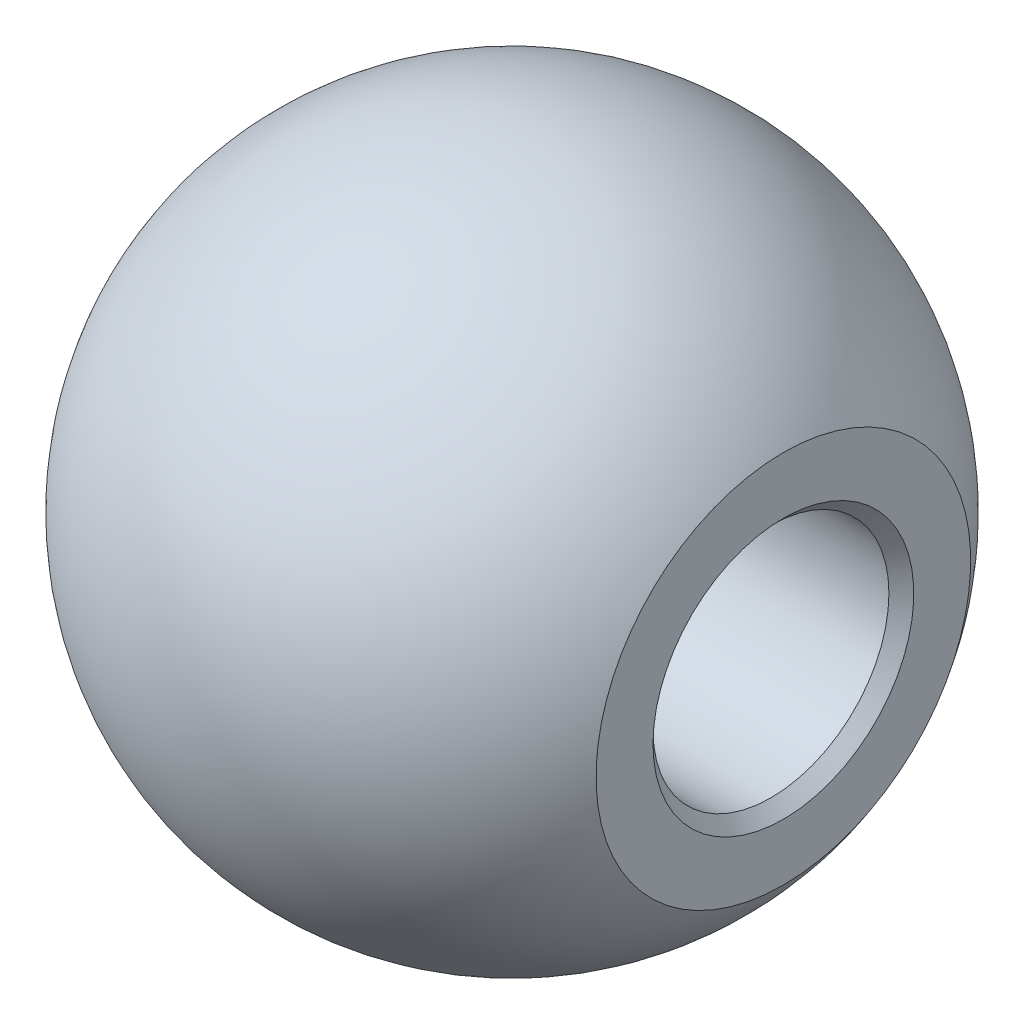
from build123d import *

# Parameters (mm, degrees)
CHAMFER1_SIZE = 0.254


with BuildPart() as part:
    # Sketch1 → Revolve1 (revolve)
    with BuildSketch(Plane.XY):
        with BuildLine():
            Line((-5.5499, 3.830939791), (-5.5499, 2.413))
            Line((-5.5499, 2.413), (5.5499, 2.413))
            Line((5.5499, 2.413), (5.5499, 3.830939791))
            ThreePointArc((5.5499, 3.830939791), (0, 6.7437), (-5.5499, 3.830939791))
        make_face()
    revolve(axis=Axis((-6.885146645, 0, 0), (1, 0, 0)))

    # Chamfer1
    chamfer1_edges = [part.edges().sort_by_distance(p)[0] for p in [
        (5.5499, -2.413, 0),
        (-5.5499, -2.413, 0),
    ]]
    chamfer(chamfer1_edges, length=CHAMFER1_SIZE)


solid = part.part
